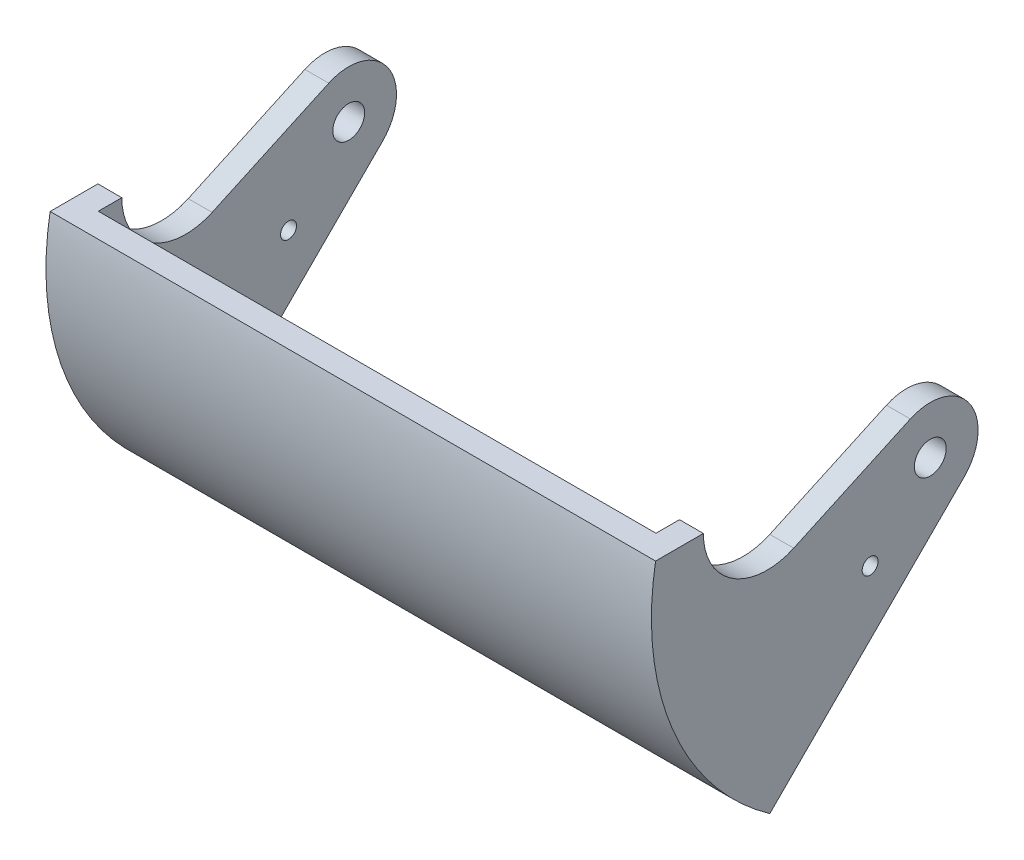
from build123d import *

# Parameters (mm, degrees)
ESQUISSE1_R         = 2
ESQUISSE1_R_2       = 1
BASE_EXTRUD_E_DEPTH = 38
EVIDEMENT_DEPTH     = 35


with BuildPart() as part:
    # Esquisse1 → Base extrud_e (new, symmetric)
    with BuildSketch(Plane(origin=(0, 0, 0), x_dir=(0, 0, -1), z_dir=(1, 0, 0))):
        with BuildLine():
            Line((-34.481879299, 6), (-28.481879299, 6))
            ThreePointArc((-28.481879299, 6), (-24.799964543, -0.734548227), (-17.143344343, -1.270088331))
            Line((-17.143344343, -1.270088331), (-2.503901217, 5.452566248))
            ThreePointArc((-2.503901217, 5.452566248), (4.924942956, 3.427088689), (4.242640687, -4.242640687))
            Line((4.242640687, -4.242640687), (-20.139729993, -28.625011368))
            ThreePointArc((-20.139729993, -28.625011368), (-32.335783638, -13.393920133), (-34.481879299, 6))
        make_face()
        Circle(ESQUISSE1_R, mode=Mode.SUBTRACT)
        with Locations((-7.549834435, -8)):
            Circle(ESQUISSE1_R_2, mode=Mode.SUBTRACT)
    extrude(amount=BASE_EXTRUD_E_DEPTH, both=True)

    # Esquisse2 → Evidement (cut, symmetric)
    with BuildSketch(Plane(origin=(0, 0, 0), x_dir=(0, 0, -1), z_dir=(1, 0, 0))):
        with BuildLine():
            Line((4.242640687, -4.242640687), (-17.983470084, -26.468751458))
            ThreePointArc((-17.983470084, -26.468751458), (-29.56414504, -12.245869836), (-31.432467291, 6))
            Line((-31.432467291, 6), (-28.481879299, 6))
            ThreePointArc((-28.481879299, 6), (-24.799964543, -0.734548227), (-17.143344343, -1.270088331))
            Line((-17.143344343, -1.270088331), (-2.503901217, 5.452566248))
            ThreePointArc((-2.503901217, 5.452566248), (4.924942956, 3.427088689), (4.242640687, -4.242640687))
        make_face()
    extrude(amount=EVIDEMENT_DEPTH, both=True, mode=Mode.SUBTRACT)


solid = part.part
